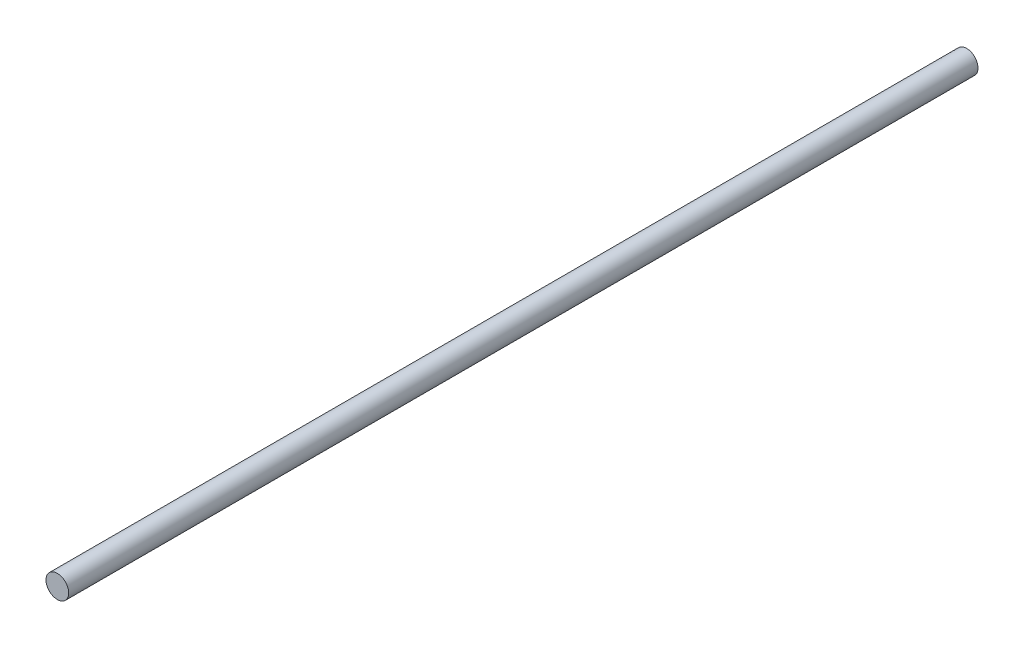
ISO-10303-21;
HEADER;
FILE_DESCRIPTION(('STEP AP214'),'2;1');
FILE_NAME('part.step','',(''),(''),'','','');
FILE_SCHEMA(('AUTOMOTIVE_DESIGN { 1 0 10303 214 1 1 1 1 }'));
ENDSEC;
DATA;
#1=APPLICATION_CONTEXT('core data for automotive mechanical design processes');
#2=APPLICATION_PROTOCOL_DEFINITION('international standard','automotive_design',2000,#1);
#3=PRODUCT_CONTEXT('',#1,'mechanical');
#4=PRODUCT('Part','Part','',(#3));
#5=PRODUCT_RELATED_PRODUCT_CATEGORY('part','',(#4));
#6=PRODUCT_DEFINITION_FORMATION('','',#4);
#7=PRODUCT_DEFINITION_CONTEXT('part definition',#1,'design');
#8=PRODUCT_DEFINITION('design','',#6,#7);
#9=PRODUCT_DEFINITION_SHAPE('','',#8);
#10=(LENGTH_UNIT() NAMED_UNIT(*) SI_UNIT(.MILLI.,.METRE.));
#11=(NAMED_UNIT(*) PLANE_ANGLE_UNIT() SI_UNIT($,.RADIAN.));
#12=(NAMED_UNIT(*) SI_UNIT($,.STERADIAN.) SOLID_ANGLE_UNIT());
#13=UNCERTAINTY_MEASURE_WITH_UNIT(LENGTH_MEASURE(1.E-05),#10,'distance_accuracy_value','');
#14=(GEOMETRIC_REPRESENTATION_CONTEXT(3) GLOBAL_UNCERTAINTY_ASSIGNED_CONTEXT((#13)) GLOBAL_UNIT_ASSIGNED_CONTEXT((#10,
#11,#12)) REPRESENTATION_CONTEXT('',''));
#15=CARTESIAN_POINT('',(0.,0.,0.));
#16=DIRECTION('',(0.,0.,1.));
#17=DIRECTION('',(1.,0.,0.));
#18=AXIS2_PLACEMENT_3D('',#15,#16,#17);
#19=CARTESIAN_POINT('',(0.,0.,1000.));
#20=DIRECTION('',(0.,0.,-1.));
#21=DIRECTION('',(-1.,0.,0.));
#22=AXIS2_PLACEMENT_3D('',#19,#20,#21);
#23=CYLINDRICAL_SURFACE('',#22,12.5);
#24=CARTESIAN_POINT('',(0.,0.,1000.));
#25=DIRECTION('',(0.,0.,1.));
#26=DIRECTION('',(1.,0.,0.));
#27=AXIS2_PLACEMENT_3D('',#24,#25,#26);
#28=CIRCLE('',#27,12.5);
#29=CARTESIAN_POINT('',(12.5,0.,1000.));
#30=VERTEX_POINT('',#29);
#31=EDGE_CURVE('E10',#30,#30,#28,.T.);
#32=ORIENTED_EDGE('',*,*,#31,.F.);
#33=EDGE_LOOP('',(#32));
#34=FACE_BOUND('',#33,.T.);
#35=CARTESIAN_POINT('',(0.,0.,0.));
#36=DIRECTION('',(0.,0.,1.));
#37=DIRECTION('',(1.,0.,0.));
#38=AXIS2_PLACEMENT_3D('',#35,#36,#37);
#39=CIRCLE('',#38,12.5);
#40=CARTESIAN_POINT('',(12.5,0.,0.));
#41=VERTEX_POINT('',#40);
#42=EDGE_CURVE('E43',#41,#41,#39,.T.);
#43=ORIENTED_EDGE('',*,*,#42,.T.);
#44=EDGE_LOOP('',(#43));
#45=FACE_BOUND('',#44,.T.);
#46=ADVANCED_FACE('F40',(#34,#45),#23,.T.);
#47=CARTESIAN_POINT('',(0.,0.,1000.));
#48=DIRECTION('',(0.,0.,1.));
#49=DIRECTION('',(1.,0.,0.));
#50=AXIS2_PLACEMENT_3D('',#47,#48,#49);
#51=PLANE('',#50);
#52=ORIENTED_EDGE('',*,*,#31,.T.);
#53=EDGE_LOOP('',(#52));
#54=FACE_BOUND('',#53,.T.);
#55=ADVANCED_FACE('F55',(#54),#51,.T.);
#56=CARTESIAN_POINT('',(0.,0.,0.));
#57=DIRECTION('',(0.,0.,1.));
#58=DIRECTION('',(1.,0.,0.));
#59=AXIS2_PLACEMENT_3D('',#56,#57,#58);
#60=PLANE('',#59);
#61=ORIENTED_EDGE('',*,*,#42,.F.);
#62=EDGE_LOOP('',(#61));
#63=FACE_BOUND('',#62,.T.);
#64=ADVANCED_FACE('F53',(#63),#60,.F.);
#65=CLOSED_SHELL('',(#46,#55,#64));
#66=MANIFOLD_SOLID_BREP('B2',#65);
#67=ADVANCED_BREP_SHAPE_REPRESENTATION('',(#18,#66),#14);
#68=SHAPE_DEFINITION_REPRESENTATION(#9,#67);
ENDSEC;
END-ISO-10303-21;
